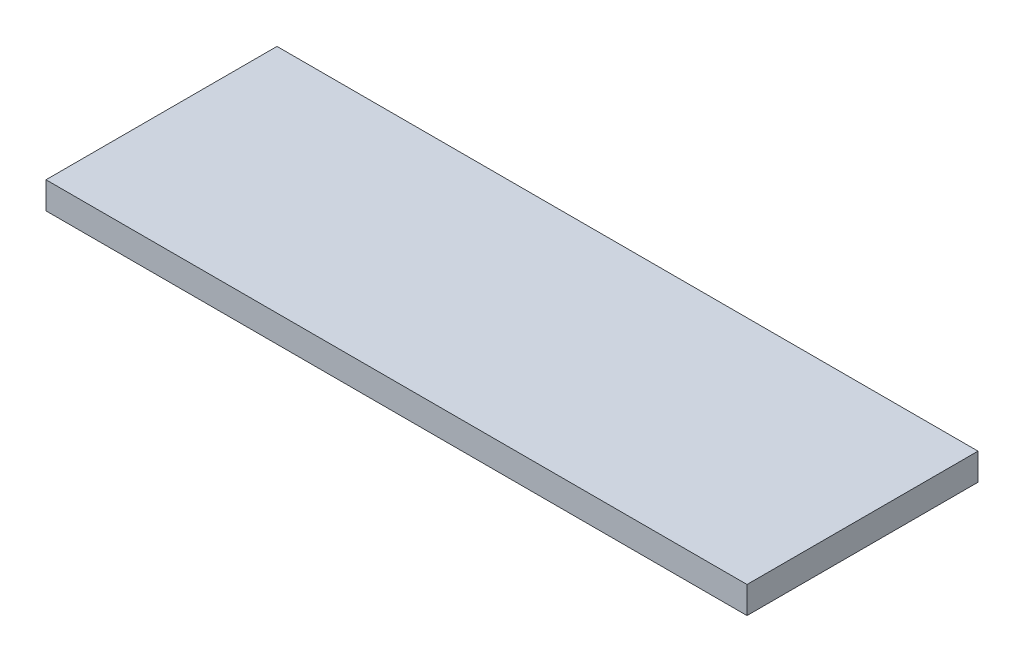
from build123d import *

# Parameters (mm, degrees)
SKETCH1_W           = 165.1
SKETCH1_H           = 54.4
BOSS_EXTRUDE1_DEPTH = 6.35


with BuildPart() as part:
    # Sketch1 → Boss-Extrude1 (new body)
    with BuildSketch(Plane(origin=(0, 0, 0), x_dir=(1, 0, 0), z_dir=(0, 1, 0))):
        with Locations((82.55, 27.2)):
            Rectangle(SKETCH1_W, SKETCH1_H)
    extrude(amount=BOSS_EXTRUDE1_DEPTH)


solid = part.part
